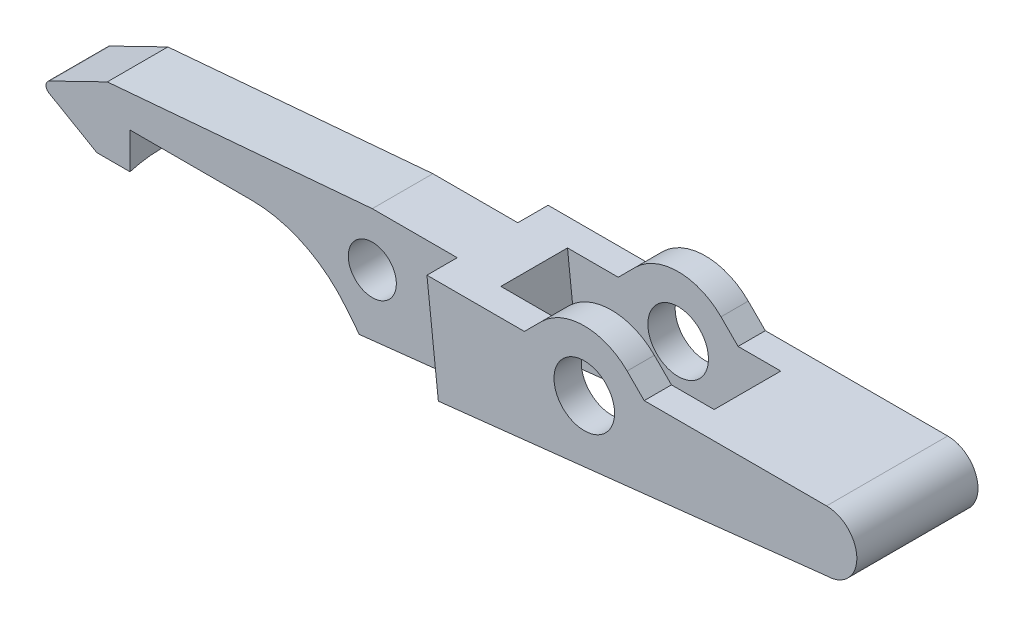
from build123d import *

# Parameters (mm, degrees)
SKETCH1_R           = 0.396875
SKETCH1_R_2         = 0.5
BOSS_EXTRUDE1_DEPTH = 2
SKETCH2_R           = 1.75
CUT_EXTRUDE1_DEPTH  = 10
FILLET1_R           = 0.1
SKETCH3_W           = 3.5
SKETCH3_H           = 1.1
SKETCH3_W_2         = 8.161877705
SKETCH3_H_2         = 1.564100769
SKETCH3_H_3         = 1.769428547
CUT_EXTRUDE2_DEPTH  = 13.83080911


with BuildPart() as part:
    # Sketch1 → Boss-Extrude1 (new body)
    with BuildSketch(Plane.XY):
        with BuildLine():
            Line((0, 0), (0, -0.625))
            Line((0, -0.625), (-0.5, -0.625))
            Line((-0.5, -0.625), (-1.5, -0.047649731))
            Line((-1.5, -0.047649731), (-0.375, 0.5))
            Line((-0.375, 0.5), (4, 0.875))
            Line((4, 0.875), (7.010786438, 0.875))
            Line((7.010786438, 0.875), (7.292893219, 1.157106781))
            ThreePointArc((7.292893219, 1.157106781), (8, 1.45), (8.707106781, 1.157106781))
            Line((8.707106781, 1.157106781), (8.989213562, 0.875))
            Line((8.989213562, 0.875), (12, 0.875))
            ThreePointArc((12, 0.875), (12.5, 0.375), (12, -0.125))
            Line((12, -0.125), (3.786208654, -1.031011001))
            Line((3.786208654, -1.031011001), (3.561330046, -0.75010061))
            ThreePointArc((3.561330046, -0.75010061), (2.866083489, -0.197252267), (2, 0))
            Line((2, 0), (0, 0))
        make_face()
        with Locations((4, 0)):
            Circle(SKETCH1_R, mode=Mode.SUBTRACT)
        with Locations((8, 0.45)):
            Circle(SKETCH1_R_2, mode=Mode.SUBTRACT)
    extrude(amount=BOSS_EXTRUDE1_DEPTH)

    # Sketch2 → Cut-Extrude1 (cut)
    with BuildSketch(Plane(origin=(0, 0, 0), x_dir=(0, 0, -1), z_dir=(1, 0, 0))):
        with Locations((-1, -2.275)):
            Circle(SKETCH2_R)
    extrude(amount=-CUT_EXTRUDE1_DEPTH, mode=Mode.SUBTRACT)

    # Fillet1
    fillet1_edges = [part.edges().sort_by_distance(p)[0] for p in [
        (-1.5, -0.047649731, 1),
    ]]
    fillet(fillet1_edges, radius=FILLET1_R)

    # Sketch3 → Cut-Extrude2 (cut, through all)
    with BuildSketch(Plane(origin=(0.157869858, -1.43122994, 0), x_dir=(0.99397151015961, 0.10963866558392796, 0), z_dir=(0.10963866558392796, -0.99397151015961, 0))):
        with Locations((7.981475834, 1)):
            Rectangle(SKETCH3_W, SKETCH3_H)
        with Locations((1.384799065, 2.282050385)):
            Rectangle(SKETCH3_W_2, SKETCH3_H_2)
        with Locations((1.384799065, -0.384714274)):
            Rectangle(SKETCH3_W_2, SKETCH3_H_3)
    extrude(amount=-CUT_EXTRUDE2_DEPTH, mode=Mode.SUBTRACT)


solid = part.part
